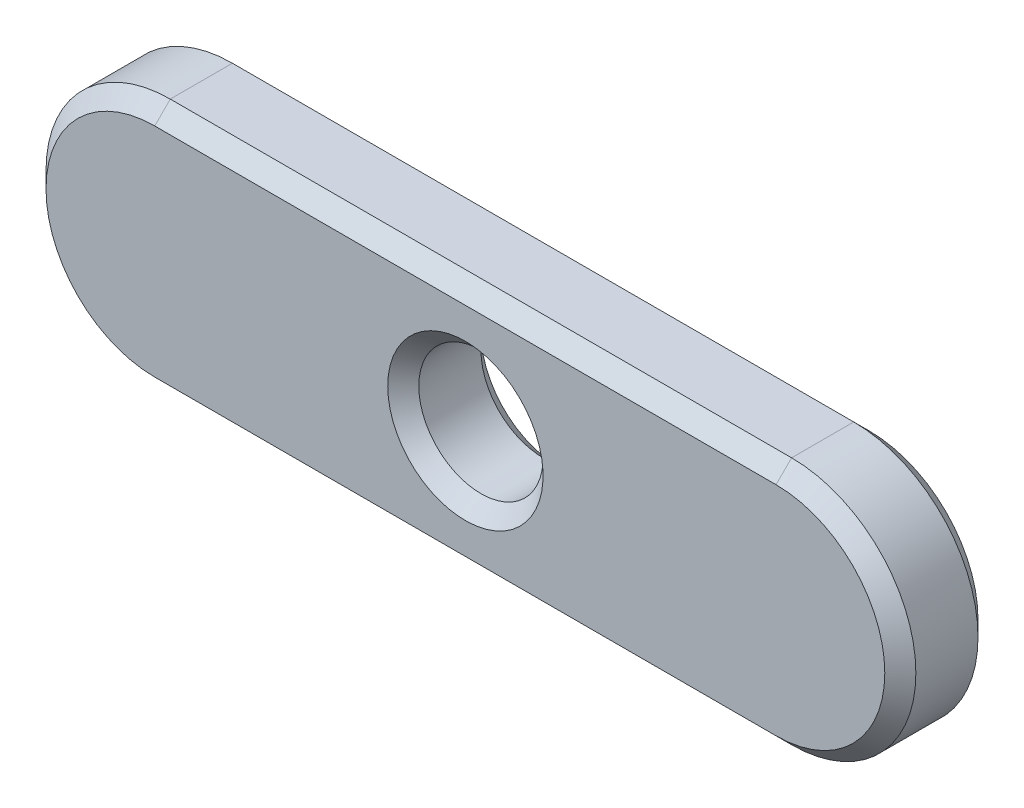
ISO-10303-21;
HEADER;
FILE_DESCRIPTION(('STEP AP214'),'2;1');
FILE_NAME('part.step','',(''),(''),'','','');
FILE_SCHEMA(('AUTOMOTIVE_DESIGN { 1 0 10303 214 1 1 1 1 }'));
ENDSEC;
DATA;
#1=APPLICATION_CONTEXT('core data for automotive mechanical design processes');
#2=APPLICATION_PROTOCOL_DEFINITION('international standard','automotive_design',2000,#1);
#3=PRODUCT_CONTEXT('',#1,'mechanical');
#4=PRODUCT('Part','Part','',(#3));
#5=PRODUCT_RELATED_PRODUCT_CATEGORY('part','',(#4));
#6=PRODUCT_DEFINITION_FORMATION('','',#4);
#7=PRODUCT_DEFINITION_CONTEXT('part definition',#1,'design');
#8=PRODUCT_DEFINITION('design','',#6,#7);
#9=PRODUCT_DEFINITION_SHAPE('','',#8);
#10=(LENGTH_UNIT() NAMED_UNIT(*) SI_UNIT(.MILLI.,.METRE.));
#11=(NAMED_UNIT(*) PLANE_ANGLE_UNIT() SI_UNIT($,.RADIAN.));
#12=(NAMED_UNIT(*) SI_UNIT($,.STERADIAN.) SOLID_ANGLE_UNIT());
#13=UNCERTAINTY_MEASURE_WITH_UNIT(LENGTH_MEASURE(1.E-05),#10,'distance_accuracy_value','');
#14=(GEOMETRIC_REPRESENTATION_CONTEXT(3) GLOBAL_UNCERTAINTY_ASSIGNED_CONTEXT((#13)) GLOBAL_UNIT_ASSIGNED_CONTEXT((#10,
#11,#12)) REPRESENTATION_CONTEXT('',''));
#15=CARTESIAN_POINT('',(0.,0.,0.));
#16=DIRECTION('',(0.,0.,1.));
#17=DIRECTION('',(1.,0.,0.));
#18=AXIS2_PLACEMENT_3D('',#15,#16,#17);
#19=CARTESIAN_POINT('',(10.,0.,3.));
#20=DIRECTION('',(0.,0.,-1.));
#21=DIRECTION('',(-1.,0.,0.));
#22=AXIS2_PLACEMENT_3D('',#19,#20,#21);
#23=CYLINDRICAL_SURFACE('',#22,4.);
#24=DIRECTION('',(0.,0.,-1.));
#25=VECTOR('',#24,1.);
#26=CARTESIAN_POINT('',(10.,4.00000000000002,3.));
#27=LINE('',#26,#25);
#28=CARTESIAN_POINT('',(10.,3.99999999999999,2.49999999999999));
#29=VERTEX_POINT('',#28);
#30=CARTESIAN_POINT('',(10.,3.99999999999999,0.5));
#31=VERTEX_POINT('',#30);
#32=EDGE_CURVE('E192',#29,#31,#27,.T.);
#33=ORIENTED_EDGE('',*,*,#32,.F.);
#34=CARTESIAN_POINT('',(10.,0.,2.49999999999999));
#35=DIRECTION('',(0.,0.,-1.));
#36=DIRECTION('',(-1.,0.,0.));
#37=AXIS2_PLACEMENT_3D('',#34,#35,#36);
#38=CIRCLE('',#37,4.);
#39=CARTESIAN_POINT('',(10.,-4.,2.49999999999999));
#40=VERTEX_POINT('',#39);
#41=EDGE_CURVE('E143',#29,#40,#38,.T.);
#42=ORIENTED_EDGE('',*,*,#41,.T.);
#43=DIRECTION('',(0.,0.,-1.));
#44=VECTOR('',#43,1.);
#45=CARTESIAN_POINT('',(10.,-4.,3.));
#46=LINE('',#45,#44);
#47=CARTESIAN_POINT('',(10.,-4.,0.500000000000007));
#48=VERTEX_POINT('',#47);
#49=EDGE_CURVE('E183',#40,#48,#46,.T.);
#50=ORIENTED_EDGE('',*,*,#49,.T.);
#51=CARTESIAN_POINT('',(10.,0.,0.500000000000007));
#52=DIRECTION('',(0.,0.,-1.));
#53=DIRECTION('',(-1.,0.,0.));
#54=AXIS2_PLACEMENT_3D('',#51,#52,#53);
#55=CIRCLE('',#54,4.);
#56=EDGE_CURVE('E141',#48,#31,#55,.F.);
#57=ORIENTED_EDGE('',*,*,#56,.T.);
#58=EDGE_LOOP('',(#33,#42,#50,#57));
#59=FACE_BOUND('',#58,.T.);
#60=ADVANCED_FACE('F34',(#59),#23,.T.);
#61=CARTESIAN_POINT('',(-10.,4.00000000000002,3.));
#62=DIRECTION('',(0.,1.,0.));
#63=DIRECTION('',(0.,0.,1.));
#64=AXIS2_PLACEMENT_3D('',#61,#62,#63);
#65=PLANE('',#64);
#66=DIRECTION('',(0.,0.,-1.));
#67=VECTOR('',#66,1.);
#68=CARTESIAN_POINT('',(-10.,4.00000000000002,3.));
#69=LINE('',#68,#67);
#70=CARTESIAN_POINT('',(-10.,3.99999999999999,2.49999999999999));
#71=VERTEX_POINT('',#70);
#72=CARTESIAN_POINT('',(-10.,3.99999999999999,0.500000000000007));
#73=VERTEX_POINT('',#72);
#74=EDGE_CURVE('E189',#71,#73,#69,.T.);
#75=ORIENTED_EDGE('',*,*,#74,.F.);
#76=DIRECTION('',(1.,0.,0.));
#77=VECTOR('',#76,1.);
#78=CARTESIAN_POINT('',(10.,3.99999999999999,2.49999999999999));
#79=LINE('',#78,#77);
#80=EDGE_CURVE('E139',#71,#29,#79,.T.);
#81=ORIENTED_EDGE('',*,*,#80,.T.);
#82=ORIENTED_EDGE('',*,*,#32,.T.);
#83=DIRECTION('',(-1.,0.,0.));
#84=VECTOR('',#83,1.);
#85=CARTESIAN_POINT('',(-10.,3.99999999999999,0.5));
#86=LINE('',#85,#84);
#87=EDGE_CURVE('E136',#31,#73,#86,.T.);
#88=ORIENTED_EDGE('',*,*,#87,.T.);
#89=EDGE_LOOP('',(#75,#81,#82,#88));
#90=FACE_BOUND('',#89,.T.);
#91=ADVANCED_FACE('F36',(#90),#65,.T.);
#92=CARTESIAN_POINT('',(-10.,0.,3.));
#93=DIRECTION('',(0.,0.,-1.));
#94=DIRECTION('',(-1.,0.,0.));
#95=AXIS2_PLACEMENT_3D('',#92,#93,#94);
#96=CYLINDRICAL_SURFACE('',#95,4.);
#97=DIRECTION('',(0.,0.,-1.));
#98=VECTOR('',#97,1.);
#99=CARTESIAN_POINT('',(-10.,-4.,3.));
#100=LINE('',#99,#98);
#101=CARTESIAN_POINT('',(-10.,-3.99999999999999,2.5));
#102=VERTEX_POINT('',#101);
#103=CARTESIAN_POINT('',(-10.,-4.,0.500000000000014));
#104=VERTEX_POINT('',#103);
#105=EDGE_CURVE('E186',#102,#104,#100,.T.);
#106=ORIENTED_EDGE('',*,*,#105,.F.);
#107=CARTESIAN_POINT('',(-10.,0.,2.5));
#108=DIRECTION('',(0.,0.,-1.));
#109=DIRECTION('',(-1.,0.,0.));
#110=AXIS2_PLACEMENT_3D('',#107,#108,#109);
#111=CIRCLE('',#110,4.);
#112=EDGE_CURVE('E134',#102,#71,#111,.T.);
#113=ORIENTED_EDGE('',*,*,#112,.T.);
#114=ORIENTED_EDGE('',*,*,#74,.T.);
#115=CARTESIAN_POINT('',(-10.,0.,0.500000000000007));
#116=DIRECTION('',(0.,0.,-1.));
#117=DIRECTION('',(-1.,0.,0.));
#118=AXIS2_PLACEMENT_3D('',#115,#116,#117);
#119=CIRCLE('',#118,4.);
#120=EDGE_CURVE('E132',#73,#104,#119,.F.);
#121=ORIENTED_EDGE('',*,*,#120,.T.);
#122=EDGE_LOOP('',(#106,#113,#114,#121));
#123=FACE_BOUND('',#122,.T.);
#124=ADVANCED_FACE('F209',(#123),#96,.T.);
#125=CARTESIAN_POINT('',(-10.,-4.,3.));
#126=DIRECTION('',(0.,1.,0.));
#127=DIRECTION('',(-1.,0.,0.));
#128=AXIS2_PLACEMENT_3D('',#125,#126,#127);
#129=PLANE('',#128);
#130=ORIENTED_EDGE('',*,*,#49,.F.);
#131=DIRECTION('',(-1.,0.,0.));
#132=VECTOR('',#131,1.);
#133=CARTESIAN_POINT('',(-10.,-3.99999999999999,2.5));
#134=LINE('',#133,#132);
#135=EDGE_CURVE('E104',#40,#102,#134,.T.);
#136=ORIENTED_EDGE('',*,*,#135,.T.);
#137=ORIENTED_EDGE('',*,*,#105,.T.);
#138=DIRECTION('',(1.,0.,0.));
#139=VECTOR('',#138,1.);
#140=CARTESIAN_POINT('',(10.,-4.,0.500000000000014));
#141=LINE('',#140,#139);
#142=EDGE_CURVE('E125',#104,#48,#141,.T.);
#143=ORIENTED_EDGE('',*,*,#142,.T.);
#144=EDGE_LOOP('',(#130,#136,#137,#143));
#145=FACE_BOUND('',#144,.T.);
#146=ADVANCED_FACE('F208',(#145),#129,.F.);
#147=CARTESIAN_POINT('',(10.,0.,3.));
#148=DIRECTION('',(0.,0.,-1.));
#149=DIRECTION('',(-1.,0.,0.));
#150=AXIS2_PLACEMENT_3D('',#147,#148,#149);
#151=PLANE('',#150);
#152=CARTESIAN_POINT('',(-10.,0.,3.));
#153=DIRECTION('',(0.,0.,-1.));
#154=DIRECTION('',(-1.,0.,0.));
#155=AXIS2_PLACEMENT_3D('',#152,#153,#154);
#156=CIRCLE('',#155,3.49999999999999);
#157=CARTESIAN_POINT('',(-10.,3.49999999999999,3.));
#158=VERTEX_POINT('',#157);
#159=CARTESIAN_POINT('',(-10.,-3.49999999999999,3.));
#160=VERTEX_POINT('',#159);
#161=EDGE_CURVE('E123',#158,#160,#156,.F.);
#162=ORIENTED_EDGE('',*,*,#161,.T.);
#163=DIRECTION('',(1.,0.,0.));
#164=VECTOR('',#163,1.);
#165=CARTESIAN_POINT('',(10.,-3.49999999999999,3.));
#166=LINE('',#165,#164);
#167=CARTESIAN_POINT('',(10.,-3.5,3.));
#168=VERTEX_POINT('',#167);
#169=EDGE_CURVE('E102',#160,#168,#166,.T.);
#170=ORIENTED_EDGE('',*,*,#169,.T.);
#171=CARTESIAN_POINT('',(10.,0.,3.));
#172=DIRECTION('',(0.,0.,-1.));
#173=DIRECTION('',(-1.,0.,0.));
#174=AXIS2_PLACEMENT_3D('',#171,#172,#173);
#175=CIRCLE('',#174,3.5);
#176=CARTESIAN_POINT('',(10.,3.49999999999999,3.));
#177=VERTEX_POINT('',#176);
#178=EDGE_CURVE('E111',#168,#177,#175,.F.);
#179=ORIENTED_EDGE('',*,*,#178,.T.);
#180=DIRECTION('',(-1.,0.,0.));
#181=VECTOR('',#180,1.);
#182=CARTESIAN_POINT('',(-10.,3.49999999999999,3.));
#183=LINE('',#182,#181);
#184=EDGE_CURVE('E117',#177,#158,#183,.T.);
#185=ORIENTED_EDGE('',*,*,#184,.T.);
#186=EDGE_LOOP('',(#162,#170,#179,#185));
#187=FACE_BOUND('',#186,.T.);
#188=CARTESIAN_POINT('',(0.,0.,3.));
#189=DIRECTION('',(0.,0.,-1.));
#190=DIRECTION('',(-1.,0.,0.));
#191=AXIS2_PLACEMENT_3D('',#188,#189,#190);
#192=CIRCLE('',#191,2.5);
#193=CARTESIAN_POINT('',(-2.5,0.,3.));
#194=VERTEX_POINT('',#193);
#195=EDGE_CURVE('E118',#194,#194,#192,.T.);
#196=ORIENTED_EDGE('',*,*,#195,.T.);
#197=EDGE_LOOP('',(#196));
#198=FACE_BOUND('',#197,.T.);
#199=ADVANCED_FACE('F120',(#187,#198),#151,.F.);
#200=CARTESIAN_POINT('',(10.,0.,0.));
#201=DIRECTION('',(0.,0.,-1.));
#202=DIRECTION('',(-1.,0.,0.));
#203=AXIS2_PLACEMENT_3D('',#200,#201,#202);
#204=PLANE('',#203);
#205=CARTESIAN_POINT('',(-10.,0.,0.));
#206=DIRECTION('',(0.,0.,-1.));
#207=DIRECTION('',(-1.,0.,0.));
#208=AXIS2_PLACEMENT_3D('',#205,#206,#207);
#209=CIRCLE('',#208,3.5);
#210=CARTESIAN_POINT('',(-10.,-3.5,0.));
#211=VERTEX_POINT('',#210);
#212=CARTESIAN_POINT('',(-10.,3.49999999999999,0.));
#213=VERTEX_POINT('',#212);
#214=EDGE_CURVE('E42',#211,#213,#209,.T.);
#215=ORIENTED_EDGE('',*,*,#214,.T.);
#216=DIRECTION('',(1.,0.,0.));
#217=VECTOR('',#216,1.);
#218=CARTESIAN_POINT('',(10.,3.49999999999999,0.));
#219=LINE('',#218,#217);
#220=CARTESIAN_POINT('',(10.,3.49999999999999,0.));
#221=VERTEX_POINT('',#220);
#222=EDGE_CURVE('E11',#213,#221,#219,.T.);
#223=ORIENTED_EDGE('',*,*,#222,.T.);
#224=CARTESIAN_POINT('',(10.,0.,0.));
#225=DIRECTION('',(0.,0.,-1.));
#226=DIRECTION('',(-1.,0.,0.));
#227=AXIS2_PLACEMENT_3D('',#224,#225,#226);
#228=CIRCLE('',#227,3.49999999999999);
#229=CARTESIAN_POINT('',(10.,-3.49999999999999,0.));
#230=VERTEX_POINT('',#229);
#231=EDGE_CURVE('E154',#221,#230,#228,.T.);
#232=ORIENTED_EDGE('',*,*,#231,.T.);
#233=DIRECTION('',(-1.,0.,0.));
#234=VECTOR('',#233,1.);
#235=CARTESIAN_POINT('',(-10.,-3.5,0.));
#236=LINE('',#235,#234);
#237=EDGE_CURVE('E52',#230,#211,#236,.T.);
#238=ORIENTED_EDGE('',*,*,#237,.T.);
#239=EDGE_LOOP('',(#215,#223,#232,#238));
#240=FACE_BOUND('',#239,.T.);
#241=CARTESIAN_POINT('',(0.,0.,0.));
#242=DIRECTION('',(0.,0.,-1.));
#243=DIRECTION('',(-1.,0.,0.));
#244=AXIS2_PLACEMENT_3D('',#241,#242,#243);
#245=CIRCLE('',#244,2.50000000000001);
#246=CARTESIAN_POINT('',(-2.50000000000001,0.,0.));
#247=VERTEX_POINT('',#246);
#248=EDGE_CURVE('E151',#247,#247,#245,.F.);
#249=ORIENTED_EDGE('',*,*,#248,.T.);
#250=EDGE_LOOP('',(#249));
#251=FACE_BOUND('',#250,.T.);
#252=ADVANCED_FACE('F157',(#240,#251),#204,.T.);
#253=CARTESIAN_POINT('',(0.,0.,0.));
#254=DIRECTION('',(0.,0.,1.));
#255=DIRECTION('',(1.,0.,0.));
#256=AXIS2_PLACEMENT_3D('',#253,#254,#255);
#257=CYLINDRICAL_SURFACE('',#256,2.);
#258=CARTESIAN_POINT('',(0.,0.,2.49999999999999));
#259=DIRECTION('',(0.,0.,-1.));
#260=DIRECTION('',(-1.,0.,0.));
#261=AXIS2_PLACEMENT_3D('',#258,#259,#260);
#262=CIRCLE('',#261,2.);
#263=CARTESIAN_POINT('',(-2.,0.,2.49999999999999));
#264=VERTEX_POINT('',#263);
#265=EDGE_CURVE('E148',#264,#264,#262,.F.);
#266=ORIENTED_EDGE('',*,*,#265,.T.);
#267=EDGE_LOOP('',(#266));
#268=FACE_BOUND('',#267,.T.);
#269=CARTESIAN_POINT('',(0.,0.,0.500000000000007));
#270=DIRECTION('',(0.,0.,-1.));
#271=DIRECTION('',(-1.,0.,0.));
#272=AXIS2_PLACEMENT_3D('',#269,#270,#271);
#273=CIRCLE('',#272,2.);
#274=CARTESIAN_POINT('',(-2.,0.,0.500000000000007));
#275=VERTEX_POINT('',#274);
#276=EDGE_CURVE('E145',#275,#275,#273,.T.);
#277=ORIENTED_EDGE('',*,*,#276,.T.);
#278=EDGE_LOOP('',(#277));
#279=FACE_BOUND('',#278,.T.);
#280=ADVANCED_FACE('F245',(#268,#279),#257,.F.);
#281=CARTESIAN_POINT('',(-10.,3.99999999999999,2.49999999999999));
#282=DIRECTION('',(0.,0.707106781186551,0.707106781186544));
#283=DIRECTION('',(0.,-0.707106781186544,0.707106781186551));
#284=AXIS2_PLACEMENT_3D('',#281,#282,#283);
#285=PLANE('',#284);
#286=DIRECTION('',(0.,-0.707106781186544,0.707106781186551));
#287=VECTOR('',#286,1.);
#288=CARTESIAN_POINT('',(10.,3.99999999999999,2.49999999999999));
#289=LINE('',#288,#287);
#290=EDGE_CURVE('E114',#29,#177,#289,.T.);
#291=ORIENTED_EDGE('',*,*,#290,.F.);
#292=ORIENTED_EDGE('',*,*,#80,.F.);
#293=DIRECTION('',(0.,0.707106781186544,-0.707106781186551));
#294=VECTOR('',#293,1.);
#295=CARTESIAN_POINT('',(-10.,3.49999999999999,3.));
#296=LINE('',#295,#294);
#297=EDGE_CURVE('E180',#158,#71,#296,.T.);
#298=ORIENTED_EDGE('',*,*,#297,.F.);
#299=ORIENTED_EDGE('',*,*,#184,.F.);
#300=EDGE_LOOP('',(#291,#292,#298,#299));
#301=FACE_BOUND('',#300,.T.);
#302=ADVANCED_FACE('F199',(#301),#285,.T.);
#303=CARTESIAN_POINT('',(-10.,0.,3.));
#304=DIRECTION('',(0.,0.,-1.));
#305=DIRECTION('',(-1.,0.,0.));
#306=AXIS2_PLACEMENT_3D('',#303,#304,#305);
#307=CONICAL_SURFACE('',#306,3.49999999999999,0.785398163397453);
#308=ORIENTED_EDGE('',*,*,#297,.T.);
#309=ORIENTED_EDGE('',*,*,#112,.F.);
#310=DIRECTION('',(0.,-0.707106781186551,-0.707106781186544));
#311=VECTOR('',#310,1.);
#312=CARTESIAN_POINT('',(-10.,-3.49999999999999,3.));
#313=LINE('',#312,#311);
#314=EDGE_CURVE('E107',#160,#102,#313,.T.);
#315=ORIENTED_EDGE('',*,*,#314,.F.);
#316=ORIENTED_EDGE('',*,*,#161,.F.);
#317=EDGE_LOOP('',(#308,#309,#315,#316));
#318=FACE_BOUND('',#317,.T.);
#319=ADVANCED_FACE('F202',(#318),#307,.T.);
#320=CARTESIAN_POINT('',(10.,0.,2.49999999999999));
#321=DIRECTION('',(0.,0.,-1.));
#322=DIRECTION('',(-1.,0.,0.));
#323=AXIS2_PLACEMENT_3D('',#320,#321,#322);
#324=CONICAL_SURFACE('',#323,4.,0.785398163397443);
#325=ORIENTED_EDGE('',*,*,#290,.T.);
#326=ORIENTED_EDGE('',*,*,#178,.F.);
#327=DIRECTION('',(0.,0.707106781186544,0.707106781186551));
#328=VECTOR('',#327,1.);
#329=CARTESIAN_POINT('',(10.,-4.,2.49999999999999));
#330=LINE('',#329,#328);
#331=EDGE_CURVE('E98',#40,#168,#330,.T.);
#332=ORIENTED_EDGE('',*,*,#331,.F.);
#333=ORIENTED_EDGE('',*,*,#41,.F.);
#334=EDGE_LOOP('',(#325,#326,#332,#333));
#335=FACE_BOUND('',#334,.T.);
#336=ADVANCED_FACE('F112',(#335),#324,.T.);
#337=CARTESIAN_POINT('',(10.,-3.49999999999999,3.));
#338=DIRECTION('',(0.,0.707106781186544,-0.707106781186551));
#339=DIRECTION('',(0.,0.707106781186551,0.707106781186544));
#340=AXIS2_PLACEMENT_3D('',#337,#338,#339);
#341=PLANE('',#340);
#342=ORIENTED_EDGE('',*,*,#314,.T.);
#343=ORIENTED_EDGE('',*,*,#135,.F.);
#344=ORIENTED_EDGE('',*,*,#331,.T.);
#345=ORIENTED_EDGE('',*,*,#169,.F.);
#346=EDGE_LOOP('',(#342,#343,#344,#345));
#347=FACE_BOUND('',#346,.T.);
#348=ADVANCED_FACE('F100',(#347),#341,.F.);
#349=CARTESIAN_POINT('',(0.,0.,2.49999999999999));
#350=DIRECTION('',(0.,0.,1.));
#351=DIRECTION('',(1.,0.,0.));
#352=AXIS2_PLACEMENT_3D('',#349,#350,#351);
#353=CONICAL_SURFACE('',#352,2.,0.785398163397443);
#354=ORIENTED_EDGE('',*,*,#195,.F.);
#355=EDGE_LOOP('',(#354));
#356=FACE_BOUND('',#355,.T.);
#357=ORIENTED_EDGE('',*,*,#265,.F.);
#358=EDGE_LOOP('',(#357));
#359=FACE_BOUND('',#358,.T.);
#360=ADVANCED_FACE('F260',(#356,#359),#353,.F.);
#361=CARTESIAN_POINT('',(-10.,-4.,0.500000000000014));
#362=DIRECTION('',(0.,-0.707106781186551,-0.707106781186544));
#363=DIRECTION('',(0.,0.707106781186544,-0.707106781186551));
#364=AXIS2_PLACEMENT_3D('',#361,#362,#363);
#365=PLANE('',#364);
#366=DIRECTION('',(0.,0.707106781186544,-0.707106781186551));
#367=VECTOR('',#366,1.);
#368=CARTESIAN_POINT('',(10.,-4.,0.500000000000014));
#369=LINE('',#368,#367);
#370=EDGE_CURVE('E167',#48,#230,#369,.T.);
#371=ORIENTED_EDGE('',*,*,#370,.F.);
#372=ORIENTED_EDGE('',*,*,#142,.F.);
#373=DIRECTION('',(0.,-0.707106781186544,0.707106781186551));
#374=VECTOR('',#373,1.);
#375=CARTESIAN_POINT('',(-10.,-3.5,0.));
#376=LINE('',#375,#374);
#377=EDGE_CURVE('E108',#211,#104,#376,.T.);
#378=ORIENTED_EDGE('',*,*,#377,.F.);
#379=ORIENTED_EDGE('',*,*,#237,.F.);
#380=EDGE_LOOP('',(#371,#372,#378,#379));
#381=FACE_BOUND('',#380,.T.);
#382=ADVANCED_FACE('F165',(#381),#365,.T.);
#383=CARTESIAN_POINT('',(-10.,0.,0.500000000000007));
#384=DIRECTION('',(0.,0.,1.));
#385=DIRECTION('',(1.,0.,0.));
#386=AXIS2_PLACEMENT_3D('',#383,#384,#385);
#387=CONICAL_SURFACE('',#386,4.,0.785398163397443);
#388=ORIENTED_EDGE('',*,*,#377,.T.);
#389=ORIENTED_EDGE('',*,*,#120,.F.);
#390=DIRECTION('',(0.,0.707106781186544,0.707106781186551));
#391=VECTOR('',#390,1.);
#392=CARTESIAN_POINT('',(-10.,3.49999999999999,0.));
#393=LINE('',#392,#391);
#394=EDGE_CURVE('E171',#213,#73,#393,.T.);
#395=ORIENTED_EDGE('',*,*,#394,.F.);
#396=ORIENTED_EDGE('',*,*,#214,.F.);
#397=EDGE_LOOP('',(#388,#389,#395,#396));
#398=FACE_BOUND('',#397,.T.);
#399=ADVANCED_FACE('F212',(#398),#387,.T.);
#400=CARTESIAN_POINT('',(10.,0.,0.));
#401=DIRECTION('',(0.,0.,1.));
#402=DIRECTION('',(1.,0.,0.));
#403=AXIS2_PLACEMENT_3D('',#400,#401,#402);
#404=CONICAL_SURFACE('',#403,3.49999999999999,0.785398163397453);
#405=ORIENTED_EDGE('',*,*,#370,.T.);
#406=ORIENTED_EDGE('',*,*,#231,.F.);
#407=DIRECTION('',(0.,-0.707106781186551,-0.707106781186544));
#408=VECTOR('',#407,1.);
#409=CARTESIAN_POINT('',(10.,3.99999999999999,0.5));
#410=LINE('',#409,#408);
#411=EDGE_CURVE('E174',#31,#221,#410,.T.);
#412=ORIENTED_EDGE('',*,*,#411,.F.);
#413=ORIENTED_EDGE('',*,*,#56,.F.);
#414=EDGE_LOOP('',(#405,#406,#412,#413));
#415=FACE_BOUND('',#414,.T.);
#416=ADVANCED_FACE('F170',(#415),#404,.T.);
#417=CARTESIAN_POINT('',(10.,3.49999999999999,0.));
#418=DIRECTION('',(0.,-0.707106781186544,0.707106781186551));
#419=DIRECTION('',(0.,-0.707106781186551,-0.707106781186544));
#420=AXIS2_PLACEMENT_3D('',#417,#418,#419);
#421=PLANE('',#420);
#422=ORIENTED_EDGE('',*,*,#394,.T.);
#423=ORIENTED_EDGE('',*,*,#87,.F.);
#424=ORIENTED_EDGE('',*,*,#411,.T.);
#425=ORIENTED_EDGE('',*,*,#222,.F.);
#426=EDGE_LOOP('',(#422,#423,#424,#425));
#427=FACE_BOUND('',#426,.T.);
#428=ADVANCED_FACE('F217',(#427),#421,.F.);
#429=CARTESIAN_POINT('',(0.,0.,0.));
#430=DIRECTION('',(0.,0.,-1.));
#431=DIRECTION('',(-1.,0.,0.));
#432=AXIS2_PLACEMENT_3D('',#429,#430,#431);
#433=CONICAL_SURFACE('',#432,2.50000000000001,0.785398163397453);
#434=ORIENTED_EDGE('',*,*,#276,.F.);
#435=EDGE_LOOP('',(#434));
#436=FACE_BOUND('',#435,.T.);
#437=ORIENTED_EDGE('',*,*,#248,.F.);
#438=EDGE_LOOP('',(#437));
#439=FACE_BOUND('',#438,.T.);
#440=ADVANCED_FACE('F219',(#436,#439),#433,.F.);
#441=CLOSED_SHELL('',(#60,#91,#124,#146,#199,#252,#280,#302,#319,#336,#348,#360,#382,#399,#416,
#428,#440));
#442=MANIFOLD_SOLID_BREP('B2',#441);
#443=ADVANCED_BREP_SHAPE_REPRESENTATION('',(#18,#442),#14);
#444=SHAPE_DEFINITION_REPRESENTATION(#9,#443);
ENDSEC;
END-ISO-10303-21;
